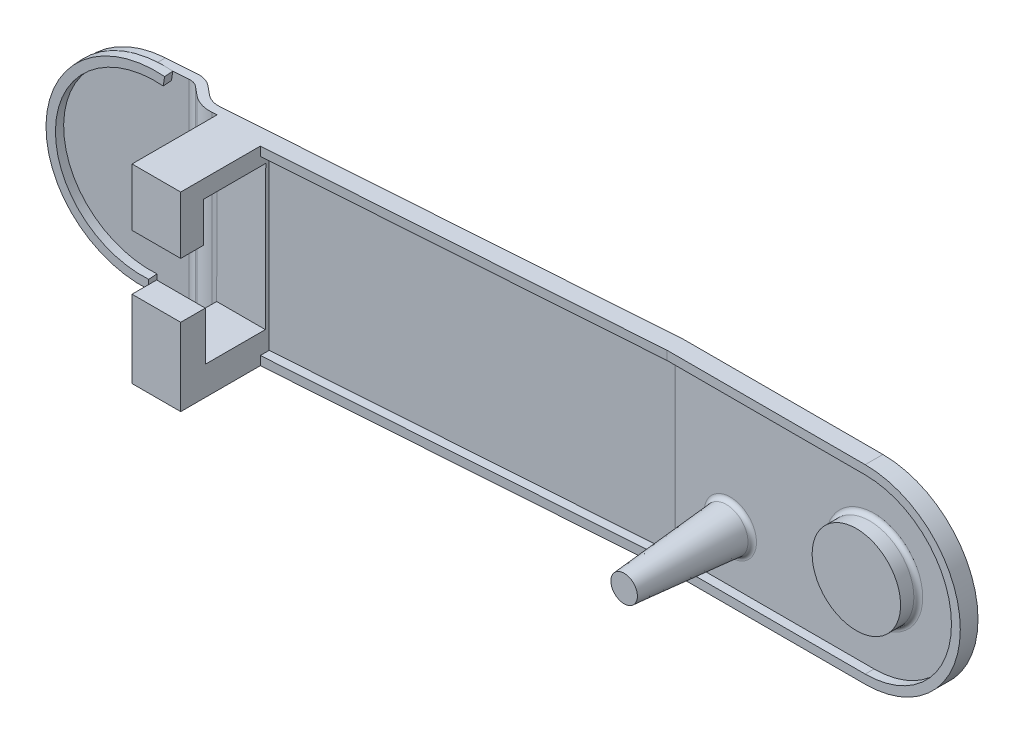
from build123d import *

# Parameters (mm, degrees)
EXTRUSION1_DEPTH        = 4
ESQUISSE2_R             = 20
EXTRUSION2_DEPTH        = 12
CONG_1_R                = 2
CONG_2_R                = 2
EXTRUSION3_DEPTH        = 52
ENL_V_MAT_EXTRU_3_DEPTH = 375.246242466
ESQUISSE33_R            = 22.5
EXTRUSION4_DEPTH        = 6
ENL_V_MAT_EXTRU_4_DEPTH = 375.246242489
ESQUISSE35_W            = 22
ESQUISSE35_H            = 86
EXTRUSION5_DEPTH        = 52
ENL_V_MAT_EXTRU_5_DEPTH = 375.822958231
ENL_V_MAT_EXTRU_6_DEPTH = 52
ESQUISSE38_W            = 179.371876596
ESQUISSE38_H            = 4
EXTRUSION6_DEPTH        = 4
ESQUISSE39_W            = 89.721030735
ESQUISSE39_H            = 4
ESQUISSE39_W_2          = 90
EXTRUSION7_DEPTH        = 4
EXTRUSION8_DEPTH        = 4
EXTRUSION9_DEPTH        = 4
ESQUISSE38_2_W          = 179.371876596
ESQUISSE38_2_H          = 4
EXTRUSION10_DEPTH       = 4


with BuildPart() as part:
    # Esquisse1 → Extrusion1 (new body)
    with BuildSketch(Plane.XY):
        with BuildLine():
            Line((0, 43), (-90, 43))
            Line((-90, 43), (-90, -43))
            Line((-90, -43), (0, -43))
            ThreePointArc((0, -43), (43, 0), (0, 43))
        make_face()
    extrude(amount=EXTRUSION1_DEPTH)

    # Esquisse2 → Extrusion2 (add)
    with BuildSketch(Plane(origin=(0, 0, 0), x_dir=(-1, 0, 0), z_dir=(0, 0, -1))):
        Circle(ESQUISSE2_R)
    extrude(amount=-EXTRUSION2_DEPTH)

    # Esquisse5 → R_volution1 (revolve)
    with BuildSketch(Plane(origin=(-65, 0, 0), x_dir=(0, 0, -1), z_dir=(1, 0, 0)), mode=Mode.PRIVATE) as r_volution1_sk:
        Polygon((-4, -16), (-4, -6), (-52, -10), (-52, -16), align=None)
    revolve(r_volution1_sk.sketch.rotate(Axis((-65, -16, 52.753324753), (0, 0, -1)), 90), axis=Axis((-65, -16, 52.753324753), (0, 0, -1)))

    # Cong_1
    cong_1_edges = [part.edges().sort_by_distance(p)[0] for p in [
        (20, 0, 4),
    ]]
    fillet(cong_1_edges, radius=CONG_1_R)

    # Cong_2
    cong_2_edges = [part.edges().sort_by_distance(p)[0] for p in [
        (-75, -16, 4),
    ]]
    fillet(cong_2_edges, radius=CONG_2_R)

    # Esquisse8 → Extrusion3 (add)
    with BuildSketch(Plane(origin=(0, 0, 0), x_dir=(-1, 0, 0), z_dir=(0, 0, -1))):
        with BuildLine():
            Line((90, -43), (317.5, -43))
            ThreePointArc((317.5, -43), (360.5, 0), (317.5, 43))
            Line((317.5, 43), (90, 43))
            Line((90, 43), (90, -43))
        make_face()
    extrude(amount=-EXTRUSION3_DEPTH)

    # Esquisse13 → Enl_v. mat.-Extru.3 (cut, through all)
    with BuildSketch(Plane(origin=(0, 43, 0), x_dir=(-1, 0, 0), z_dir=(0, 1, 0))):
        with BuildLine():
            Line((90, 0), (361.799468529, 0))
            Line((361.799468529, 0), (361.799468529, 10))
            Line((361.799468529, 10), (304.001663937, 5.958383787))
            ThreePointArc((304.001663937, 5.958383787), (300.23753084, 6.415822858), (296.914307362, 8.241784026))
            Line((296.914307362, 8.241784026), (293.085692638, 11.422138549))
            ThreePointArc((293.085692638, 11.422138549), (289.76246916, 13.248099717), (285.998336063, 13.705538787))
            Line((285.998336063, 13.705538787), (90, 0))
        make_face()
    extrude(amount=-ENL_V_MAT_EXTRU_3_DEPTH, mode=Mode.SUBTRACT)

    # Esquisse33 → Extrusion4 (add)
    with BuildSketch(Plane.XY.offset(5)):
        with Locations(Location((-317.5, 0, 0), (0, 0, 306.864601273))):
            Circle(ESQUISSE33_R)
    extrude(amount=EXTRUSION4_DEPTH)

    # Esquisse34 → Enl_v. mat.-Extru.4 (cut, through all)
    with BuildSketch(Plane(origin=(0, 43, 0), x_dir=(-1, 0, 0), z_dir=(0, 1, 0))):
        with BuildLine():
            Line((89.720974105, 3.990256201), (90, 52))
            Line((90, 52), (382.34299016, 52))
            Line((382.34299016, 52), (382.34299016, 15.446310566))
            Line((382.34299016, 15.446310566), (317.220974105, 10.892535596))
            Line((317.220974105, 10.892535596), (303.722638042, 9.948639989))
            ThreePointArc((303.722638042, 9.948639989), (301.464158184, 10.223103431), (299.470224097, 11.318680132))
            Line((299.470224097, 11.318680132), (295.641609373, 14.499034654))
            ThreePointArc((295.641609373, 14.499034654), (290.989096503, 17.055380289), (285.719310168, 17.695794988))
            Line((285.719310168, 17.695794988), (89.720974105, 3.990256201))
        make_face()
    extrude(amount=-ENL_V_MAT_EXTRU_4_DEPTH, mode=Mode.SUBTRACT)

    # Esquisse35 → Extrusion5 (add)
    with BuildSketch(Plane.XY.offset(4)):
        with Locations((-272.5, 0)):
            Rectangle(ESQUISSE35_W, ESQUISSE35_H)
    extrude(amount=EXTRUSION5_DEPTH)

    # Esquisse36 → Enl_v. mat.-Extru.5 (cut, through all)
    with BuildSketch(Plane(origin=(0, 43, 0), x_dir=(-1, 0, 0), z_dir=(0, 1, 0))):
        Polygon((261.5, 11.992448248), (283.5, 13.530838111), (283.5, 4), (261.5, 4), align=None)
    extrude(amount=-ENL_V_MAT_EXTRU_5_DEPTH, mode=Mode.SUBTRACT)

    # Esquisse37 → Enl_v. mat.-Extru.6 (cut)
    with BuildSketch(Plane.ZY.offset(283.5)):
        Polygon((56, 17), (45.638956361, 17), (45.638956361, 35), (17.540605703, 35), (17.729898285, -30), (44.892408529, -30), (44.892408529, -8), (56, -8), align=None)
    extrude(amount=-ENL_V_MAT_EXTRU_6_DEPTH, mode=Mode.SUBTRACT)

    # Esquisse38 → Extrusion6 (add)
    with BuildSketch(Plane(origin=(-0.158911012, 0, -2.272533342), x_dir=(0.9975640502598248, 0, -0.06975647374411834), z_dir=(0.06975647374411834, 0, 0.9975640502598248))):
        with Locations((-177.495885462, 41)):
            Rectangle(ESQUISSE38_W, ESQUISSE38_H)
        with Locations((-177.495885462, -41)):
            Rectangle(ESQUISSE38_W, ESQUISSE38_H)
    extrude(amount=EXTRUSION6_DEPTH)

    # Esquisse39 → Extrusion7 (add)
    with BuildSketch(Plane.XY.offset(4)):
        with Locations((-44.860515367, 41)):
            Rectangle(ESQUISSE39_W, ESQUISSE39_H)
        with Locations((-45, -41)):
            Rectangle(ESQUISSE39_W_2, ESQUISSE39_H)
    extrude(amount=EXTRUSION7_DEPTH)

    # Esquisse40 → Extrusion8 (add)
    with BuildSketch(Plane.XY.offset(4)):
        with BuildLine():
            Line((0, 43), (0, 39))
            ThreePointArc((0, 39), (39, 0), (0, -39))
            Line((0, -39), (0, -43))
            ThreePointArc((0, -43), (43, 0), (0, 43))
        make_face()
    extrude(amount=EXTRUSION8_DEPTH)

    # Esquisse42 → Extrusion9 (add)
    with BuildSketch(Plane(origin=(-0.785612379, 0, -11.234780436), x_dir=(0.9975640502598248, 0, -0.06975647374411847), z_dir=(0.06975647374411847, 0, 0.9975640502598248))):
        with BuildLine():
            Line((-310.582269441, 43), (-311.202495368, 39.048377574))
            ThreePointArc((-311.202495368, 39.048377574), (-356.738056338, 3.073722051), (-317.331323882, -39.526425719))
            Line((-317.331323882, -39.526425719), (-317.331323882, -43.526425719))
            ThreePointArc((-317.331323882, -43.526425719), (-360.725943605, 3.384776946), (-310.582269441, 43))
        make_face()
    extrude(amount=EXTRUSION9_DEPTH)

    # Esquisse38_2 → Extrusion10 (add)
    with BuildSketch(Plane(origin=(-0.158911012, 0, -2.272533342), x_dir=(0.9975640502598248, 0, -0.06975647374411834), z_dir=(0.06975647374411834, 0, 0.9975640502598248))):
        with Locations((-177.495885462, 41)):
            Rectangle(ESQUISSE38_2_W, ESQUISSE38_2_H)
        with Locations((-177.495885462, -41)):
            Rectangle(ESQUISSE38_2_W, ESQUISSE38_2_H)
    extrude(amount=EXTRUSION10_DEPTH)


solid = part.part
